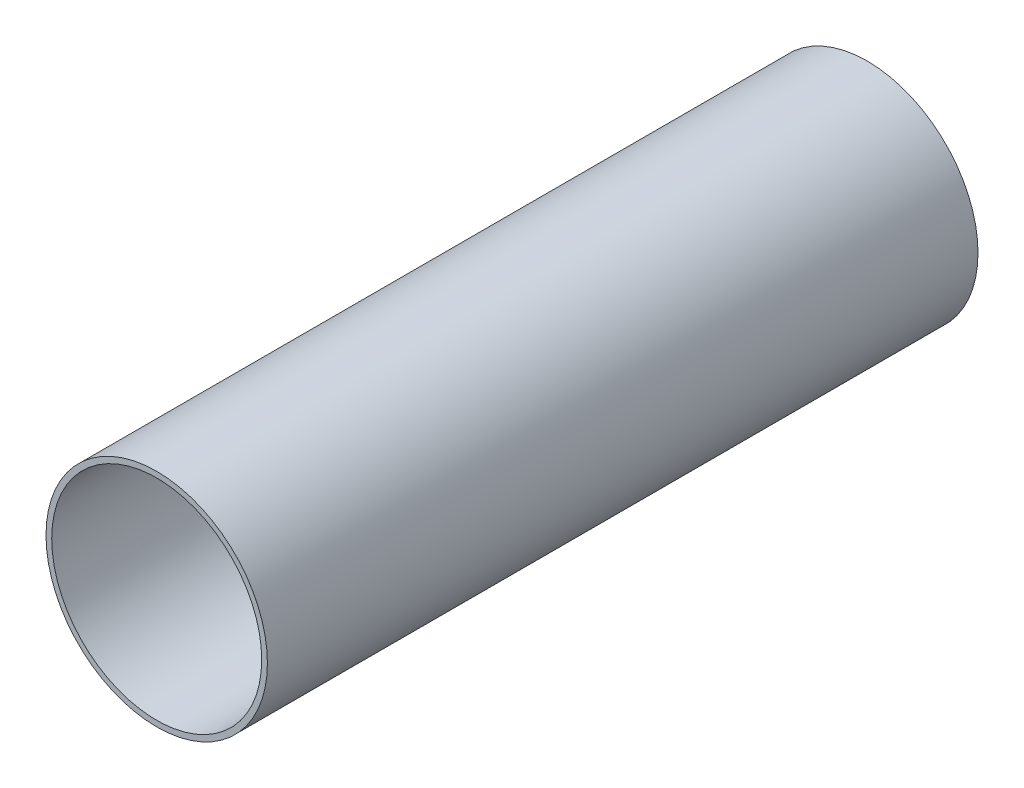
ISO-10303-21;
HEADER;
FILE_DESCRIPTION(('STEP AP214'),'2;1');
FILE_NAME('part.step','',(''),(''),'','','');
FILE_SCHEMA(('AUTOMOTIVE_DESIGN { 1 0 10303 214 1 1 1 1 }'));
ENDSEC;
DATA;
#1=APPLICATION_CONTEXT('core data for automotive mechanical design processes');
#2=APPLICATION_PROTOCOL_DEFINITION('international standard','automotive_design',2000,#1);
#3=PRODUCT_CONTEXT('',#1,'mechanical');
#4=PRODUCT('Part','Part','',(#3));
#5=PRODUCT_RELATED_PRODUCT_CATEGORY('part','',(#4));
#6=PRODUCT_DEFINITION_FORMATION('','',#4);
#7=PRODUCT_DEFINITION_CONTEXT('part definition',#1,'design');
#8=PRODUCT_DEFINITION('design','',#6,#7);
#9=PRODUCT_DEFINITION_SHAPE('','',#8);
#10=(LENGTH_UNIT() NAMED_UNIT(*) SI_UNIT(.MILLI.,.METRE.));
#11=(NAMED_UNIT(*) PLANE_ANGLE_UNIT() SI_UNIT($,.RADIAN.));
#12=(NAMED_UNIT(*) SI_UNIT($,.STERADIAN.) SOLID_ANGLE_UNIT());
#13=UNCERTAINTY_MEASURE_WITH_UNIT(LENGTH_MEASURE(1.E-05),#10,'distance_accuracy_value','');
#14=(GEOMETRIC_REPRESENTATION_CONTEXT(3) GLOBAL_UNCERTAINTY_ASSIGNED_CONTEXT((#13)) GLOBAL_UNIT_ASSIGNED_CONTEXT((#10,
#11,#12)) REPRESENTATION_CONTEXT('',''));
#15=CARTESIAN_POINT('',(0.,0.,0.));
#16=DIRECTION('',(0.,0.,1.));
#17=DIRECTION('',(1.,0.,0.));
#18=AXIS2_PLACEMENT_3D('',#15,#16,#17);
#19=CARTESIAN_POINT('',(0.,0.,257.81));
#20=DIRECTION('',(0.,0.,1.));
#21=DIRECTION('',(1.,0.,0.));
#22=AXIS2_PLACEMENT_3D('',#19,#20,#21);
#23=PLANE('',#22);
#24=CARTESIAN_POINT('',(0.,0.,257.81));
#25=DIRECTION('',(0.,0.,1.));
#26=DIRECTION('',(1.,0.,0.));
#27=AXIS2_PLACEMENT_3D('',#24,#25,#26);
#28=CIRCLE('',#27,40.64);
#29=CARTESIAN_POINT('',(40.64,0.,257.81));
#30=VERTEX_POINT('',#29);
#31=EDGE_CURVE('E10',#30,#30,#28,.T.);
#32=ORIENTED_EDGE('',*,*,#31,.T.);
#33=EDGE_LOOP('',(#32));
#34=FACE_BOUND('',#33,.T.);
#35=CARTESIAN_POINT('',(0.,0.,257.81));
#36=DIRECTION('',(0.,0.,1.));
#37=DIRECTION('',(1.,0.,0.));
#38=AXIS2_PLACEMENT_3D('',#35,#36,#37);
#39=CIRCLE('',#38,38.5445);
#40=CARTESIAN_POINT('',(38.5445,0.,257.81));
#41=VERTEX_POINT('',#40);
#42=EDGE_CURVE('E39',#41,#41,#39,.T.);
#43=ORIENTED_EDGE('',*,*,#42,.F.);
#44=EDGE_LOOP('',(#43));
#45=FACE_BOUND('',#44,.T.);
#46=ADVANCED_FACE('F32',(#34,#45),#23,.T.);
#47=CARTESIAN_POINT('',(0.,0.,257.81));
#48=DIRECTION('',(0.,0.,-1.));
#49=DIRECTION('',(-1.,0.,0.));
#50=AXIS2_PLACEMENT_3D('',#47,#48,#49);
#51=CYLINDRICAL_SURFACE('',#50,40.64);
#52=ORIENTED_EDGE('',*,*,#31,.F.);
#53=EDGE_LOOP('',(#52));
#54=FACE_BOUND('',#53,.T.);
#55=CARTESIAN_POINT('',(0.,0.,-3.048));
#56=DIRECTION('',(0.,0.,-1.));
#57=DIRECTION('',(-1.,0.,0.));
#58=AXIS2_PLACEMENT_3D('',#55,#56,#57);
#59=CIRCLE('',#58,40.64);
#60=CARTESIAN_POINT('',(-40.64,0.,-3.048));
#61=VERTEX_POINT('',#60);
#62=EDGE_CURVE('E48',#61,#61,#59,.T.);
#63=ORIENTED_EDGE('',*,*,#62,.F.);
#64=EDGE_LOOP('',(#63));
#65=FACE_BOUND('',#64,.T.);
#66=ADVANCED_FACE('F34',(#54,#65),#51,.T.);
#67=CARTESIAN_POINT('',(0.,0.,257.81));
#68=DIRECTION('',(0.,0.,-1.));
#69=DIRECTION('',(-1.,0.,0.));
#70=AXIS2_PLACEMENT_3D('',#67,#68,#69);
#71=CYLINDRICAL_SURFACE('',#70,38.5445);
#72=ORIENTED_EDGE('',*,*,#42,.T.);
#73=EDGE_LOOP('',(#72));
#74=FACE_BOUND('',#73,.T.);
#75=CARTESIAN_POINT('',(0.,0.,0.));
#76=DIRECTION('',(0.,0.,1.));
#77=DIRECTION('',(1.,0.,0.));
#78=AXIS2_PLACEMENT_3D('',#75,#76,#77);
#79=CIRCLE('',#78,38.5445);
#80=CARTESIAN_POINT('',(38.5445,0.,0.));
#81=VERTEX_POINT('',#80);
#82=EDGE_CURVE('E43',#81,#81,#79,.T.);
#83=ORIENTED_EDGE('',*,*,#82,.F.);
#84=EDGE_LOOP('',(#83));
#85=FACE_BOUND('',#84,.T.);
#86=ADVANCED_FACE('F72',(#74,#85),#71,.F.);
#87=CARTESIAN_POINT('',(0.,0.,0.));
#88=DIRECTION('',(0.,0.,-1.));
#89=DIRECTION('',(-1.,0.,0.));
#90=AXIS2_PLACEMENT_3D('',#87,#88,#89);
#91=PLANE('',#90);
#92=CARTESIAN_POINT('',(0.,0.,0.));
#93=DIRECTION('',(0.,0.,-1.));
#94=DIRECTION('',(-1.,0.,0.));
#95=AXIS2_PLACEMENT_3D('',#92,#93,#94);
#96=CIRCLE('',#95,24.13);
#97=CARTESIAN_POINT('',(24.13,0.,0.));
#98=VERTEX_POINT('',#97);
#99=EDGE_CURVE('E53',#98,#98,#96,.T.);
#100=ORIENTED_EDGE('',*,*,#99,.T.);
#101=EDGE_LOOP('',(#100));
#102=FACE_BOUND('',#101,.T.);
#103=ORIENTED_EDGE('',*,*,#82,.T.);
#104=EDGE_LOOP('',(#103));
#105=FACE_BOUND('',#104,.T.);
#106=ADVANCED_FACE('F64',(#102,#105),#91,.F.);
#107=CARTESIAN_POINT('',(0.,0.,-3.048));
#108=DIRECTION('',(0.,0.,-1.));
#109=DIRECTION('',(-1.,0.,0.));
#110=AXIS2_PLACEMENT_3D('',#107,#108,#109);
#111=PLANE('',#110);
#112=ORIENTED_EDGE('',*,*,#62,.T.);
#113=EDGE_LOOP('',(#112));
#114=FACE_BOUND('',#113,.T.);
#115=CARTESIAN_POINT('',(0.,0.,-3.048));
#116=DIRECTION('',(0.,0.,-1.));
#117=DIRECTION('',(-1.,0.,0.));
#118=AXIS2_PLACEMENT_3D('',#115,#116,#117);
#119=CIRCLE('',#118,24.13);
#120=CARTESIAN_POINT('',(24.13,0.,-3.048));
#121=VERTEX_POINT('',#120);
#122=EDGE_CURVE('E52',#121,#121,#119,.T.);
#123=ORIENTED_EDGE('',*,*,#122,.F.);
#124=EDGE_LOOP('',(#123));
#125=FACE_BOUND('',#124,.T.);
#126=ADVANCED_FACE('F62',(#114,#125),#111,.T.);
#127=CARTESIAN_POINT('',(0.,0.,-3.048));
#128=DIRECTION('',(0.,0.,1.));
#129=DIRECTION('',(1.,0.,0.));
#130=AXIS2_PLACEMENT_3D('',#127,#128,#129);
#131=CYLINDRICAL_SURFACE('',#130,24.13);
#132=CARTESIAN_POINT('',(24.13,0.,-3.048));
#133=CARTESIAN_POINT('',(24.13,0.,-3.01625));
#134=CARTESIAN_POINT('',(24.13,0.,-2.9845));
#135=CARTESIAN_POINT('',(24.13,0.,-2.921));
#136=CARTESIAN_POINT('',(24.13,0.,-2.88925));
#137=CARTESIAN_POINT('',(24.13,0.,-2.82575));
#138=CARTESIAN_POINT('',(24.13,0.,-2.794));
#139=CARTESIAN_POINT('',(24.13,0.,-2.7305));
#140=CARTESIAN_POINT('',(24.13,0.,-2.69875));
#141=CARTESIAN_POINT('',(24.13,0.,-2.63525));
#142=CARTESIAN_POINT('',(24.13,0.,-2.6035));
#143=CARTESIAN_POINT('',(24.13,0.,-2.54));
#144=CARTESIAN_POINT('',(24.13,0.,-2.50825));
#145=CARTESIAN_POINT('',(24.13,0.,-2.44475));
#146=CARTESIAN_POINT('',(24.13,0.,-2.413));
#147=CARTESIAN_POINT('',(24.13,0.,-2.3495));
#148=CARTESIAN_POINT('',(24.13,0.,-2.31775));
#149=CARTESIAN_POINT('',(24.13,0.,-2.25425));
#150=CARTESIAN_POINT('',(24.13,0.,-2.2225));
#151=CARTESIAN_POINT('',(24.13,0.,-2.159));
#152=CARTESIAN_POINT('',(24.13,0.,-2.12725));
#153=CARTESIAN_POINT('',(24.13,0.,-2.06375));
#154=CARTESIAN_POINT('',(24.13,0.,-2.032));
#155=CARTESIAN_POINT('',(24.13,0.,-1.9685));
#156=CARTESIAN_POINT('',(24.13,0.,-1.93675));
#157=CARTESIAN_POINT('',(24.13,0.,-1.87325));
#158=CARTESIAN_POINT('',(24.13,0.,-1.8415));
#159=CARTESIAN_POINT('',(24.13,0.,-1.778));
#160=CARTESIAN_POINT('',(24.13,0.,-1.74625));
#161=CARTESIAN_POINT('',(24.13,0.,-1.68275));
#162=CARTESIAN_POINT('',(24.13,0.,-1.651));
#163=CARTESIAN_POINT('',(24.13,0.,-1.5875));
#164=CARTESIAN_POINT('',(24.13,0.,-1.55575));
#165=CARTESIAN_POINT('',(24.13,0.,-1.49225));
#166=CARTESIAN_POINT('',(24.13,0.,-1.4605));
#167=CARTESIAN_POINT('',(24.13,0.,-1.397));
#168=CARTESIAN_POINT('',(24.13,0.,-1.36525));
#169=CARTESIAN_POINT('',(24.13,0.,-1.30175));
#170=CARTESIAN_POINT('',(24.13,0.,-1.27));
#171=CARTESIAN_POINT('',(24.13,0.,-1.2065));
#172=CARTESIAN_POINT('',(24.13,0.,-1.17475));
#173=CARTESIAN_POINT('',(24.13,0.,-1.11125));
#174=CARTESIAN_POINT('',(24.13,0.,-1.0795));
#175=CARTESIAN_POINT('',(24.13,0.,-1.016));
#176=CARTESIAN_POINT('',(24.13,0.,-0.98425));
#177=CARTESIAN_POINT('',(24.13,0.,-0.92075));
#178=CARTESIAN_POINT('',(24.13,0.,-0.889));
#179=CARTESIAN_POINT('',(24.13,0.,-0.8255));
#180=CARTESIAN_POINT('',(24.13,0.,-0.79375));
#181=CARTESIAN_POINT('',(24.13,0.,-0.73025));
#182=CARTESIAN_POINT('',(24.13,0.,-0.6985));
#183=CARTESIAN_POINT('',(24.13,0.,-0.635));
#184=CARTESIAN_POINT('',(24.13,0.,-0.60325));
#185=CARTESIAN_POINT('',(24.13,0.,-0.53975));
#186=CARTESIAN_POINT('',(24.13,0.,-0.508));
#187=CARTESIAN_POINT('',(24.13,0.,-0.4445));
#188=CARTESIAN_POINT('',(24.13,0.,-0.41275));
#189=CARTESIAN_POINT('',(24.13,0.,-0.34925));
#190=CARTESIAN_POINT('',(24.13,0.,-0.3175));
#191=CARTESIAN_POINT('',(24.13,0.,-0.254));
#192=CARTESIAN_POINT('',(24.13,0.,-0.22225));
#193=CARTESIAN_POINT('',(24.13,0.,-0.15875));
#194=CARTESIAN_POINT('',(24.13,0.,-0.127));
#195=CARTESIAN_POINT('',(24.13,0.,-0.0634999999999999));
#196=CARTESIAN_POINT('',(24.13,0.,-0.03175));
#197=CARTESIAN_POINT('',(24.13,0.,0.));
#198=B_SPLINE_CURVE_WITH_KNOTS('',3,(#132,#133,#134,#135,#136,#137,#138,#139,#140,#141,#142,
#143,#144,#145,#146,#147,#148,#149,#150,#151,#152,#153,#154,#155,#156,#157,#158,#159,#160,#161,
#162,#163,#164,#165,#166,#167,#168,#169,#170,#171,#172,#173,#174,#175,#176,#177,#178,#179,#180,
#181,#182,#183,#184,#185,#186,#187,#188,#189,#190,#191,#192,#193,#194,#195,#196,#197),
.UNSPECIFIED.,.F.,.F.,(4,2,2,2,2,2,2,2,2,2,2,2,2,2,2,2,2,2,2,2,2,2,2,2,2,2,2,2,2,2,2,2,4),(0.,
0.0952499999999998,0.1905,0.28575,0.381,0.47625,0.5715,0.66675,0.762,0.85725,0.9525,1.04775,
1.143,1.23825,1.3335,1.42875,1.524,1.61925,1.7145,1.80975,1.905,2.00025,2.0955,2.19075,2.286,
2.38125,2.4765,2.57175,2.667,2.76225,2.8575,2.95275,3.048),.UNSPECIFIED.);
#199=EDGE_CURVE('BSEAM59',#121,#98,#198,.T.);
#200=ORIENTED_EDGE('',*,*,#122,.T.);
#201=ORIENTED_EDGE('',*,*,#99,.F.);
#202=ORIENTED_EDGE('',*,*,#199,.T.);
#203=ORIENTED_EDGE('',*,*,#199,.F.);
#204=EDGE_LOOP('',(#200,#202,#201,#203));
#205=FACE_BOUND('',#204,.T.);
#206=ADVANCED_FACE('F59',(#205),#131,.F.);
#207=CLOSED_SHELL('',(#46,#66,#86,#106,#126,#206));
#208=MANIFOLD_SOLID_BREP('B2',#207);
#209=ADVANCED_BREP_SHAPE_REPRESENTATION('',(#18,#208),#14);
#210=SHAPE_DEFINITION_REPRESENTATION(#9,#209);
ENDSEC;
END-ISO-10303-21;
